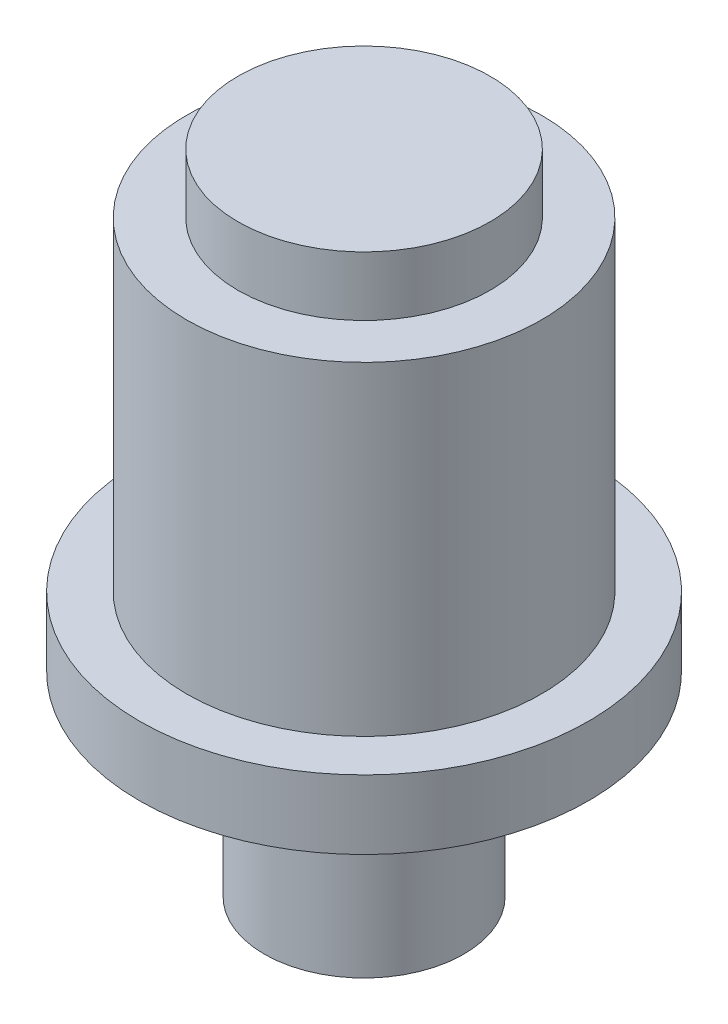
ISO-10303-21;
HEADER;
FILE_DESCRIPTION(('STEP AP214'),'2;1');
FILE_NAME('part.step','',(''),(''),'','','');
FILE_SCHEMA(('AUTOMOTIVE_DESIGN { 1 0 10303 214 1 1 1 1 }'));
ENDSEC;
DATA;
#1=APPLICATION_CONTEXT('core data for automotive mechanical design processes');
#2=APPLICATION_PROTOCOL_DEFINITION('international standard','automotive_design',2000,#1);
#3=PRODUCT_CONTEXT('',#1,'mechanical');
#4=PRODUCT('Part','Part','',(#3));
#5=PRODUCT_RELATED_PRODUCT_CATEGORY('part','',(#4));
#6=PRODUCT_DEFINITION_FORMATION('','',#4);
#7=PRODUCT_DEFINITION_CONTEXT('part definition',#1,'design');
#8=PRODUCT_DEFINITION('design','',#6,#7);
#9=PRODUCT_DEFINITION_SHAPE('','',#8);
#10=(LENGTH_UNIT() NAMED_UNIT(*) SI_UNIT(.MILLI.,.METRE.));
#11=(NAMED_UNIT(*) PLANE_ANGLE_UNIT() SI_UNIT($,.RADIAN.));
#12=(NAMED_UNIT(*) SI_UNIT($,.STERADIAN.) SOLID_ANGLE_UNIT());
#13=UNCERTAINTY_MEASURE_WITH_UNIT(LENGTH_MEASURE(1.E-05),#10,'distance_accuracy_value','');
#14=(GEOMETRIC_REPRESENTATION_CONTEXT(3) GLOBAL_UNCERTAINTY_ASSIGNED_CONTEXT((#13)) GLOBAL_UNIT_ASSIGNED_CONTEXT((#10,
#11,#12)) REPRESENTATION_CONTEXT('',''));
#15=CARTESIAN_POINT('',(0.,0.,0.));
#16=DIRECTION('',(0.,0.,1.));
#17=DIRECTION('',(1.,0.,0.));
#18=AXIS2_PLACEMENT_3D('',#15,#16,#17);
#19=CARTESIAN_POINT('',(0.,-62.6058472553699,0.));
#20=DIRECTION('',(0.,1.,0.));
#21=DIRECTION('',(0.,0.,1.));
#22=AXIS2_PLACEMENT_3D('',#19,#20,#21);
#23=PLANE('',#22);
#24=CARTESIAN_POINT('',(0.,-62.6058472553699,0.));
#25=DIRECTION('',(0.,1.,0.));
#26=DIRECTION('',(0.,0.,1.));
#27=AXIS2_PLACEMENT_3D('',#24,#25,#26);
#28=CIRCLE('',#27,17.5162899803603);
#29=CARTESIAN_POINT('',(0.,-62.6058472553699,17.5162899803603));
#30=VERTEX_POINT('',#29);
#31=EDGE_CURVE('E10',#30,#30,#28,.T.);
#32=ORIENTED_EDGE('',*,*,#31,.F.);
#33=EDGE_LOOP('',(#32));
#34=FACE_BOUND('',#33,.T.);
#35=ADVANCED_FACE('F28',(#34),#23,.F.);
#36=CARTESIAN_POINT('',(0.,0.,0.));
#37=DIRECTION('',(0.,1.,0.));
#38=DIRECTION('',(0.,0.,1.));
#39=AXIS2_PLACEMENT_3D('',#36,#37,#38);
#40=CYLINDRICAL_SURFACE('',#39,17.5162899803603);
#41=CARTESIAN_POINT('',(0.,-28.3400954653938,0.));
#42=DIRECTION('',(0.,1.,0.));
#43=DIRECTION('',(0.,0.,1.));
#44=AXIS2_PLACEMENT_3D('',#41,#42,#43);
#45=CIRCLE('',#44,17.5162899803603);
#46=CARTESIAN_POINT('',(0.,-28.3400954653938,17.5162899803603));
#47=VERTEX_POINT('',#46);
#48=EDGE_CURVE('E34',#47,#47,#45,.T.);
#49=ORIENTED_EDGE('',*,*,#48,.F.);
#50=EDGE_LOOP('',(#49));
#51=FACE_BOUND('',#50,.T.);
#52=ORIENTED_EDGE('',*,*,#31,.T.);
#53=EDGE_LOOP('',(#52));
#54=FACE_BOUND('',#53,.T.);
#55=ADVANCED_FACE('F94',(#51,#54),#40,.T.);
#56=CARTESIAN_POINT('',(0.,-28.3400954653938,-17.5162899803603));
#57=DIRECTION('',(0.,1.,0.));
#58=DIRECTION('',(0.,0.,1.));
#59=AXIS2_PLACEMENT_3D('',#56,#57,#58);
#60=PLANE('',#59);
#61=CARTESIAN_POINT('',(0.,-28.3400954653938,0.));
#62=DIRECTION('',(0.,1.,0.));
#63=DIRECTION('',(0.,0.,1.));
#64=AXIS2_PLACEMENT_3D('',#61,#62,#63);
#65=CIRCLE('',#64,39.4154546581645);
#66=CARTESIAN_POINT('',(0.,-28.3400954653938,39.4154546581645));
#67=VERTEX_POINT('',#66);
#68=EDGE_CURVE('E38',#67,#67,#65,.T.);
#69=ORIENTED_EDGE('',*,*,#68,.F.);
#70=EDGE_LOOP('',(#69));
#71=FACE_BOUND('',#70,.T.);
#72=ORIENTED_EDGE('',*,*,#48,.T.);
#73=EDGE_LOOP('',(#72));
#74=FACE_BOUND('',#73,.T.);
#75=ADVANCED_FACE('F89',(#71,#74),#60,.F.);
#76=CARTESIAN_POINT('',(0.,0.,0.));
#77=DIRECTION('',(0.,1.,0.));
#78=DIRECTION('',(0.,0.,1.));
#79=AXIS2_PLACEMENT_3D('',#76,#77,#78);
#80=CYLINDRICAL_SURFACE('',#79,39.4154546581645);
#81=CARTESIAN_POINT('',(0.,-16.2311455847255,0.));
#82=DIRECTION('',(0.,1.,0.));
#83=DIRECTION('',(0.,0.,1.));
#84=AXIS2_PLACEMENT_3D('',#81,#82,#83);
#85=CIRCLE('',#84,39.4154546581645);
#86=CARTESIAN_POINT('',(0.,-16.2311455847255,39.4154546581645));
#87=VERTEX_POINT('',#86);
#88=EDGE_CURVE('E42',#87,#87,#85,.T.);
#89=ORIENTED_EDGE('',*,*,#88,.F.);
#90=EDGE_LOOP('',(#89));
#91=FACE_BOUND('',#90,.T.);
#92=ORIENTED_EDGE('',*,*,#68,.T.);
#93=EDGE_LOOP('',(#92));
#94=FACE_BOUND('',#93,.T.);
#95=ADVANCED_FACE('F83',(#91,#94),#80,.T.);
#96=CARTESIAN_POINT('',(0.,-16.2311455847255,-39.4154546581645));
#97=DIRECTION('',(0.,-1.,0.));
#98=DIRECTION('',(0.,0.,-1.));
#99=AXIS2_PLACEMENT_3D('',#96,#97,#98);
#100=PLANE('',#99);
#101=CARTESIAN_POINT('',(0.,-16.2311455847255,0.));
#102=DIRECTION('',(0.,1.,0.));
#103=DIRECTION('',(0.,0.,1.));
#104=AXIS2_PLACEMENT_3D('',#101,#102,#103);
#105=CIRCLE('',#104,31.1453410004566);
#106=CARTESIAN_POINT('',(0.,-16.2311455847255,31.1453410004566));
#107=VERTEX_POINT('',#106);
#108=EDGE_CURVE('E47',#107,#107,#105,.T.);
#109=ORIENTED_EDGE('',*,*,#108,.F.);
#110=EDGE_LOOP('',(#109));
#111=FACE_BOUND('',#110,.T.);
#112=ORIENTED_EDGE('',*,*,#88,.T.);
#113=EDGE_LOOP('',(#112));
#114=FACE_BOUND('',#113,.T.);
#115=ADVANCED_FACE('F77',(#111,#114),#100,.F.);
#116=CARTESIAN_POINT('',(0.,0.,0.));
#117=DIRECTION('',(0.,1.,0.));
#118=DIRECTION('',(0.,0.,1.));
#119=AXIS2_PLACEMENT_3D('',#116,#117,#118);
#120=CYLINDRICAL_SURFACE('',#119,31.1453410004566);
#121=CARTESIAN_POINT('',(0.,40.6446236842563,0.));
#122=DIRECTION('',(0.,1.,0.));
#123=DIRECTION('',(0.,0.,1.));
#124=AXIS2_PLACEMENT_3D('',#121,#122,#123);
#125=CIRCLE('',#124,31.1453410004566);
#126=CARTESIAN_POINT('',(0.,40.6446236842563,31.1453410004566));
#127=VERTEX_POINT('',#126);
#128=EDGE_CURVE('E50',#127,#127,#125,.T.);
#129=ORIENTED_EDGE('',*,*,#128,.F.);
#130=EDGE_LOOP('',(#129));
#131=FACE_BOUND('',#130,.T.);
#132=ORIENTED_EDGE('',*,*,#108,.T.);
#133=EDGE_LOOP('',(#132));
#134=FACE_BOUND('',#133,.T.);
#135=ADVANCED_FACE('F71',(#131,#134),#120,.T.);
#136=CARTESIAN_POINT('',(0.,40.6446236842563,-31.1453410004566));
#137=DIRECTION('',(0.,-1.,0.));
#138=DIRECTION('',(0.,0.,-1.));
#139=AXIS2_PLACEMENT_3D('',#136,#137,#138);
#140=PLANE('',#139);
#141=CARTESIAN_POINT('',(0.,40.6446236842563,0.));
#142=DIRECTION('',(0.,1.,0.));
#143=DIRECTION('',(0.,0.,1.));
#144=AXIS2_PLACEMENT_3D('',#141,#142,#143);
#145=CIRCLE('',#144,22.1431625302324);
#146=CARTESIAN_POINT('',(0.,40.6446236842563,22.1431625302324));
#147=VERTEX_POINT('',#146);
#148=EDGE_CURVE('E53',#147,#147,#145,.T.);
#149=ORIENTED_EDGE('',*,*,#148,.F.);
#150=EDGE_LOOP('',(#149));
#151=FACE_BOUND('',#150,.T.);
#152=ORIENTED_EDGE('',*,*,#128,.T.);
#153=EDGE_LOOP('',(#152));
#154=FACE_BOUND('',#153,.T.);
#155=ADVANCED_FACE('F65',(#151,#154),#140,.F.);
#156=CARTESIAN_POINT('',(0.,0.,0.));
#157=DIRECTION('',(0.,1.,0.));
#158=DIRECTION('',(0.,0.,1.));
#159=AXIS2_PLACEMENT_3D('',#156,#157,#158);
#160=CYLINDRICAL_SURFACE('',#159,22.1431625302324);
#161=CARTESIAN_POINT('',(0.,51.0739767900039,0.));
#162=DIRECTION('',(0.,1.,0.));
#163=DIRECTION('',(0.,0.,1.));
#164=AXIS2_PLACEMENT_3D('',#161,#162,#163);
#165=CIRCLE('',#164,22.1431625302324);
#166=CARTESIAN_POINT('',(0.,51.0739767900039,22.1431625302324));
#167=VERTEX_POINT('',#166);
#168=EDGE_CURVE('E56',#167,#167,#165,.T.);
#169=ORIENTED_EDGE('',*,*,#168,.F.);
#170=EDGE_LOOP('',(#169));
#171=FACE_BOUND('',#170,.T.);
#172=ORIENTED_EDGE('',*,*,#148,.T.);
#173=EDGE_LOOP('',(#172));
#174=FACE_BOUND('',#173,.T.);
#175=ADVANCED_FACE('F62',(#171,#174),#160,.T.);
#176=CARTESIAN_POINT('',(0.,51.0739767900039,-22.1431625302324));
#177=DIRECTION('',(0.,-1.,0.));
#178=DIRECTION('',(0.,0.,-1.));
#179=AXIS2_PLACEMENT_3D('',#176,#177,#178);
#180=PLANE('',#179);
#181=ORIENTED_EDGE('',*,*,#168,.T.);
#182=EDGE_LOOP('',(#181));
#183=FACE_BOUND('',#182,.T.);
#184=ADVANCED_FACE('F60',(#183),#180,.F.);
#185=CLOSED_SHELL('',(#35,#55,#75,#95,#115,#135,#155,#175,#184));
#186=MANIFOLD_SOLID_BREP('B2',#185);
#187=ADVANCED_BREP_SHAPE_REPRESENTATION('',(#18,#186),#14);
#188=SHAPE_DEFINITION_REPRESENTATION(#9,#187);
ENDSEC;
END-ISO-10303-21;
